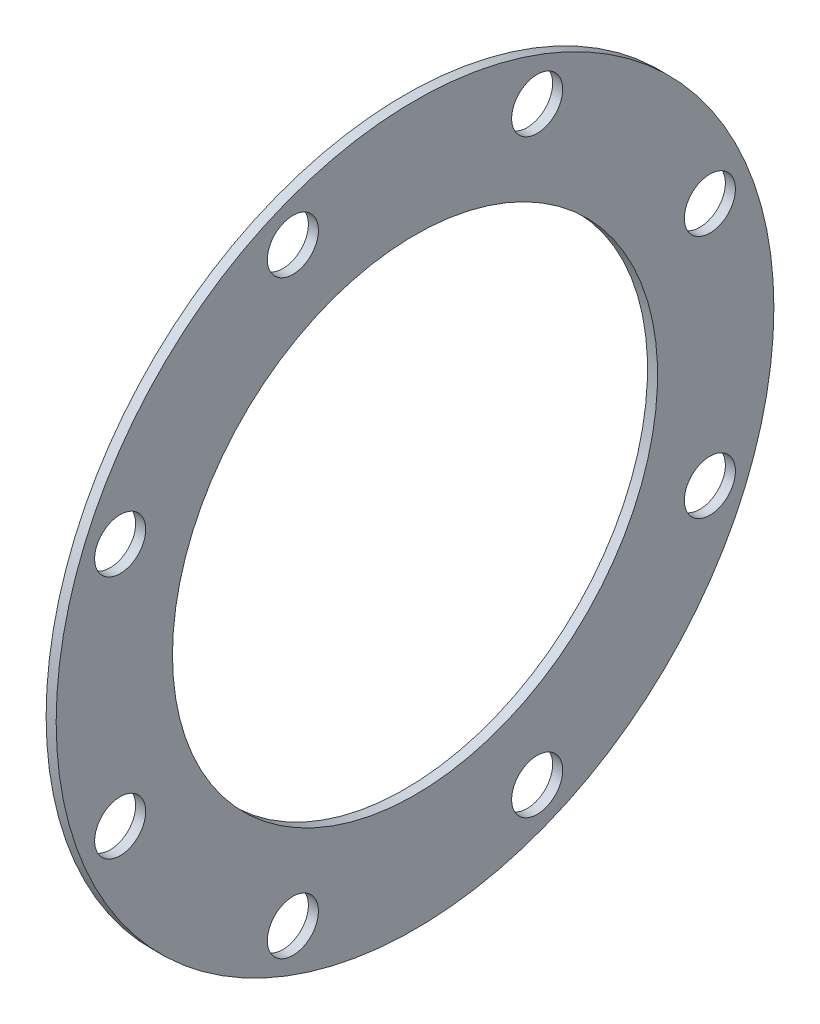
from build123d import *

# Parameters (mm, degrees)
SKETCH1_W                         = 5
SKETCH1_H                         = 57.85
SKETCH2_R                         = 12.7
F_25_4_MM_HOLE_CUT_EXTRUDE1_DEPTH = 253.48663331
F_25_4MM_HOLES_CIRPATTERN1_COUNT  = 8


with BuildPart() as part:
    # Sketch1 → Revolve1 (revolve)
    with BuildSketch(Plane.XY, mode=Mode.PRIVATE) as revolve1_sk:
        with Locations((2.5, 149.575)):
            Rectangle(SKETCH1_W, SKETCH1_H)
    revolve(revolve1_sk.sketch.rotate(Axis((0, 0, 0), (1, 0, 0)), 90), axis=Axis((0, 0, 0), (1, 0, 0)))

    # Sketch2 → 25.4 mm hole Cut-Extrude1 (cut, through all)
    with BuildSketch(Plane.ZY):
        with Locations((60.750994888, 146.665875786)):
            Circle(SKETCH2_R)
    f_25_4_mm_hole_cut_extrude1 = extrude(amount=-F_25_4_MM_HOLE_CUT_EXTRUDE1_DEPTH, mode=Mode.SUBTRACT)

    # 25.4mm holes CirPattern1: 25.4 mm hole Cut-Extrude1 ×8 about axis
    f_25_4mm_holes_cirpattern1_axis = Axis((0, 0, 0), (1, 0, 0))
    for i in range(1, F_25_4MM_HOLES_CIRPATTERN1_COUNT):
        add(f_25_4_mm_hole_cut_extrude1.rotate(f_25_4mm_holes_cirpattern1_axis, i * 360 / F_25_4MM_HOLES_CIRPATTERN1_COUNT), mode=Mode.SUBTRACT)


solid = part.part
